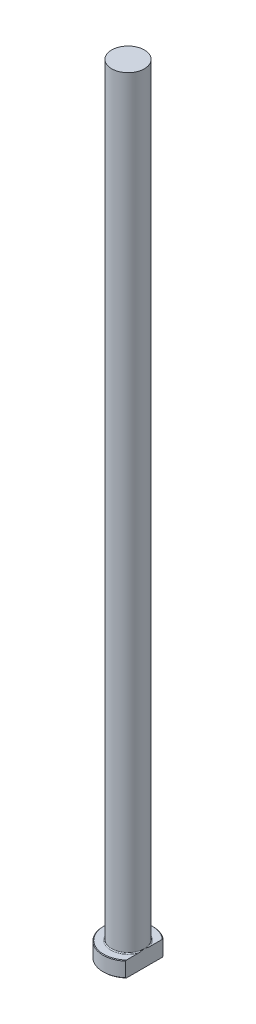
ISO-10303-21;
HEADER;
FILE_DESCRIPTION(('STEP AP214'),'2;1');
FILE_NAME('part.step','',(''),(''),'','','');
FILE_SCHEMA(('AUTOMOTIVE_DESIGN { 1 0 10303 214 1 1 1 1 }'));
ENDSEC;
DATA;
#1=APPLICATION_CONTEXT('core data for automotive mechanical design processes');
#2=APPLICATION_PROTOCOL_DEFINITION('international standard','automotive_design',2000,#1);
#3=PRODUCT_CONTEXT('',#1,'mechanical');
#4=PRODUCT('Part','Part','',(#3));
#5=PRODUCT_RELATED_PRODUCT_CATEGORY('part','',(#4));
#6=PRODUCT_DEFINITION_FORMATION('','',#4);
#7=PRODUCT_DEFINITION_CONTEXT('part definition',#1,'design');
#8=PRODUCT_DEFINITION('design','',#6,#7);
#9=PRODUCT_DEFINITION_SHAPE('','',#8);
#10=(LENGTH_UNIT() NAMED_UNIT(*) SI_UNIT(.MILLI.,.METRE.));
#11=(NAMED_UNIT(*) PLANE_ANGLE_UNIT() SI_UNIT($,.RADIAN.));
#12=(NAMED_UNIT(*) SI_UNIT($,.STERADIAN.) SOLID_ANGLE_UNIT());
#13=UNCERTAINTY_MEASURE_WITH_UNIT(LENGTH_MEASURE(1.E-05),#10,'distance_accuracy_value','');
#14=(GEOMETRIC_REPRESENTATION_CONTEXT(3) GLOBAL_UNCERTAINTY_ASSIGNED_CONTEXT((#13)) GLOBAL_UNIT_ASSIGNED_CONTEXT((#10,
#11,#12)) REPRESENTATION_CONTEXT('',''));
#15=CARTESIAN_POINT('',(0.,0.,0.));
#16=DIRECTION('',(0.,0.,1.));
#17=DIRECTION('',(1.,0.,0.));
#18=AXIS2_PLACEMENT_3D('',#15,#16,#17);
#19=CARTESIAN_POINT('',(0.,0.,0.));
#20=DIRECTION('',(0.,-1.,0.));
#21=DIRECTION('',(0.,0.,-1.));
#22=AXIS2_PLACEMENT_3D('',#19,#20,#21);
#23=PLANE('',#22);
#24=CARTESIAN_POINT('',(0.,0.,0.));
#25=DIRECTION('',(0.,-1.,0.));
#26=DIRECTION('',(0.,0.,-1.));
#27=AXIS2_PLACEMENT_3D('',#24,#25,#26);
#28=CIRCLE('',#27,7.79999999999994);
#29=CARTESIAN_POINT('',(5.24999999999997,0.,5.76866535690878));
#30=VERTEX_POINT('',#29);
#31=CARTESIAN_POINT('',(5.24999999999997,0.,-5.76866535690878));
#32=VERTEX_POINT('',#31);
#33=EDGE_CURVE('E98',#30,#32,#28,.T.);
#34=ORIENTED_EDGE('',*,*,#33,.T.);
#35=DIRECTION('',(0.,0.,1.));
#36=VECTOR('',#35,1.);
#37=CARTESIAN_POINT('',(5.24999999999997,0.,-6.0363482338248));
#38=LINE('',#37,#36);
#39=EDGE_CURVE('E83',#32,#30,#38,.T.);
#40=ORIENTED_EDGE('',*,*,#39,.T.);
#41=EDGE_LOOP('',(#34,#40));
#42=FACE_BOUND('',#41,.T.);
#43=ADVANCED_FACE('F32',(#42),#23,.T.);
#44=CARTESIAN_POINT('',(0.,259.958771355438,0.));
#45=DIRECTION('',(0.,1.,0.));
#46=DIRECTION('',(0.,0.,1.));
#47=AXIS2_PLACEMENT_3D('',#44,#45,#46);
#48=CYLINDRICAL_SURFACE('',#47,7.99999999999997);
#49=CARTESIAN_POINT('',(0.,4.80000000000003,0.));
#50=DIRECTION('',(0.,1.,0.));
#51=DIRECTION('',(0.,0.,1.));
#52=AXIS2_PLACEMENT_3D('',#49,#50,#51);
#53=CIRCLE('',#52,7.99999999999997);
#54=CARTESIAN_POINT('',(5.24999999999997,4.80000000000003,6.0363482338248));
#55=VERTEX_POINT('',#54);
#56=CARTESIAN_POINT('',(5.24999999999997,4.80000000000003,-6.0363482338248));
#57=VERTEX_POINT('',#56);
#58=EDGE_CURVE('E104',#55,#57,#53,.F.);
#59=ORIENTED_EDGE('',*,*,#58,.T.);
#60=DIRECTION('',(0.,-1.,0.));
#61=VECTOR('',#60,1.);
#62=CARTESIAN_POINT('',(5.24999999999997,250.,-6.0363482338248));
#63=LINE('',#62,#61);
#64=CARTESIAN_POINT('',(5.24999999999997,0.200000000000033,-6.0363482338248));
#65=VERTEX_POINT('',#64);
#66=EDGE_CURVE('E183',#57,#65,#63,.T.);
#67=ORIENTED_EDGE('',*,*,#66,.T.);
#68=CARTESIAN_POINT('',(0.,0.200000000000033,0.));
#69=DIRECTION('',(0.,-1.,0.));
#70=DIRECTION('',(0.,0.,-1.));
#71=AXIS2_PLACEMENT_3D('',#68,#69,#70);
#72=CIRCLE('',#71,7.99999999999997);
#73=CARTESIAN_POINT('',(5.24999999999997,0.200000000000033,6.0363482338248));
#74=VERTEX_POINT('',#73);
#75=EDGE_CURVE('E100',#65,#74,#72,.F.);
#76=ORIENTED_EDGE('',*,*,#75,.T.);
#77=DIRECTION('',(0.,-1.,0.));
#78=VECTOR('',#77,1.);
#79=CARTESIAN_POINT('',(5.24999999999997,250.,6.0363482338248));
#80=LINE('',#79,#78);
#81=EDGE_CURVE('E93',#55,#74,#80,.T.);
#82=ORIENTED_EDGE('',*,*,#81,.F.);
#83=EDGE_LOOP('',(#59,#67,#76,#82));
#84=FACE_BOUND('',#83,.T.);
#85=ADVANCED_FACE('F158',(#84),#48,.T.);
#86=CARTESIAN_POINT('',(-7.99999999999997,5.,0.));
#87=DIRECTION('',(0.,1.,0.));
#88=DIRECTION('',(0.,0.,1.));
#89=AXIS2_PLACEMENT_3D('',#86,#87,#88);
#90=PLANE('',#89);
#91=CARTESIAN_POINT('',(0.,5.,0.));
#92=DIRECTION('',(0.,1.,0.));
#93=DIRECTION('',(0.,0.,1.));
#94=AXIS2_PLACEMENT_3D('',#91,#92,#93);
#95=CIRCLE('',#94,7.79999999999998);
#96=CARTESIAN_POINT('',(5.24999999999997,5.,-5.76866535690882));
#97=VERTEX_POINT('',#96);
#98=CARTESIAN_POINT('',(5.24999999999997,5.,5.76866535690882));
#99=VERTEX_POINT('',#98);
#100=EDGE_CURVE('E178',#97,#99,#95,.T.);
#101=ORIENTED_EDGE('',*,*,#100,.T.);
#102=DIRECTION('',(0.,0.,-1.));
#103=VECTOR('',#102,1.);
#104=CARTESIAN_POINT('',(5.24999999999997,5.,0.));
#105=LINE('',#104,#103);
#106=CARTESIAN_POINT('',(5.24999999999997,4.99999999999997,1.79999999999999));
#107=VERTEX_POINT('',#106);
#108=EDGE_CURVE('E57',#99,#107,#105,.T.);
#109=ORIENTED_EDGE('',*,*,#108,.T.);
#110=CARTESIAN_POINT('',(0.,5.,0.));
#111=DIRECTION('',(0.,1.,0.));
#112=DIRECTION('',(0.,0.,1.));
#113=AXIS2_PLACEMENT_3D('',#110,#111,#112);
#114=CIRCLE('',#113,5.54999999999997);
#115=CARTESIAN_POINT('',(5.24999999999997,4.99999999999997,-1.79999999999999));
#116=VERTEX_POINT('',#115);
#117=EDGE_CURVE('E107',#107,#116,#114,.F.);
#118=ORIENTED_EDGE('',*,*,#117,.T.);
#119=EDGE_CURVE('E136',#116,#97,#105,.T.);
#120=ORIENTED_EDGE('',*,*,#119,.T.);
#121=EDGE_LOOP('',(#101,#109,#118,#120));
#122=FACE_BOUND('',#121,.T.);
#123=ADVANCED_FACE('F147',(#122),#90,.T.);
#124=CARTESIAN_POINT('',(0.,5.,0.));
#125=DIRECTION('',(0.,-1.,0.));
#126=DIRECTION('',(0.,0.,-1.));
#127=AXIS2_PLACEMENT_3D('',#124,#125,#126);
#128=CONICAL_SURFACE('',#127,7.79999999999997,0.785398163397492);
#129=ORIENTED_EDGE('',*,*,#58,.F.);
#130=CARTESIAN_POINT('',(5.24999999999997,-1.48116632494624,13.2811600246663));
#131=CARTESIAN_POINT('',(5.24999999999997,-1.29357250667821,13.0794377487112));
#132=CARTESIAN_POINT('',(5.24999999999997,-1.10628451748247,12.8774311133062));
#133=CARTESIAN_POINT('',(5.24999999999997,-0.732415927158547,12.4727618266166));
#134=CARTESIAN_POINT('',(5.24999999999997,-0.545835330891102,12.2700991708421));
#135=CARTESIAN_POINT('',(5.24999999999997,0.0127787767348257,11.6609122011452));
#136=CARTESIAN_POINT('',(5.24999999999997,0.383603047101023,11.2532764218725));
#137=CARTESIAN_POINT('',(5.24999999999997,1.12325341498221,10.4315008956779));
#138=CARTESIAN_POINT('',(5.24999999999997,1.49205195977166,10.017336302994));
#139=CARTESIAN_POINT('',(5.24999999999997,2.22349880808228,9.18368237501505));
#140=CARTESIAN_POINT('',(5.24999999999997,2.58614786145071,8.7641936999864));
#141=CARTESIAN_POINT('',(5.24999999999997,3.2300874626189,8.00331710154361));
#142=CARTESIAN_POINT('',(5.24999999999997,3.51299211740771,7.66330157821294));
#143=CARTESIAN_POINT('',(5.24999999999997,3.93141579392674,7.1483720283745));
#144=CARTESIAN_POINT('',(5.24999999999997,4.06992138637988,6.97588542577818));
#145=CARTESIAN_POINT('',(5.24999999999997,4.34452705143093,6.62901010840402));
#146=CARTESIAN_POINT('',(5.24999999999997,4.48062717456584,6.45462143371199));
#147=CARTESIAN_POINT('',(5.24999999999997,4.74973822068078,6.10383934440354));
#148=CARTESIAN_POINT('',(5.24999999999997,4.88275300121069,5.92744889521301));
#149=CARTESIAN_POINT('',(5.24999999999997,5.14521399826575,5.57203856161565));
#150=CARTESIAN_POINT('',(5.24999999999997,5.27466038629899,5.39301880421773));
#151=CARTESIAN_POINT('',(5.24999999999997,5.5290748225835,5.03192492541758));
#152=CARTESIAN_POINT('',(5.24999999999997,5.65404469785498,4.84985209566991));
#153=CARTESIAN_POINT('',(5.24999999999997,5.89840426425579,4.48201214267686));
#154=CARTESIAN_POINT('',(5.24999999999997,6.01779462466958,4.29624546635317));
#155=CARTESIAN_POINT('',(5.24999999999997,6.24171029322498,3.93290441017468));
#156=CARTESIAN_POINT('',(5.24999999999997,6.34669562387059,3.75561494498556));
#157=CARTESIAN_POINT('',(5.24999999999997,6.5488301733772,3.39656407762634));
#158=CARTESIAN_POINT('',(5.24999999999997,6.64597853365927,3.21480218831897));
#159=CARTESIAN_POINT('',(5.24999999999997,6.83020392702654,2.84629933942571));
#160=CARTESIAN_POINT('',(5.24999999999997,6.91728535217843,2.65956059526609));
#161=CARTESIAN_POINT('',(5.24999999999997,7.07861709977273,2.28058919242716));
#162=CARTESIAN_POINT('',(5.24999999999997,7.15287080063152,2.08835799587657));
#163=CARTESIAN_POINT('',(5.24999999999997,7.27107095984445,1.73993363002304));
#164=CARTESIAN_POINT('',(5.24999999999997,7.31810380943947,1.58479376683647));
#165=CARTESIAN_POINT('',(5.24999999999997,7.40035184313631,1.27142880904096));
#166=CARTESIAN_POINT('',(5.24999999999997,7.43557139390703,1.11320487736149));
#167=CARTESIAN_POINT('',(5.24999999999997,7.49247262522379,0.794842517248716));
#168=CARTESIAN_POINT('',(5.24999999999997,7.5141983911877,0.634712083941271));
#169=CARTESIAN_POINT('',(5.24999999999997,7.5431070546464,0.313132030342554));
#170=CARTESIAN_POINT('',(5.24999999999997,7.55029089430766,0.151682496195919));
#171=CARTESIAN_POINT('',(5.24999999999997,7.54968998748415,-0.1717266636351));
#172=CARTESIAN_POINT('',(5.24999999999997,7.54185529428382,-0.333686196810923));
#173=CARTESIAN_POINT('',(5.24999999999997,7.5115849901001,-0.656223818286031));
#174=CARTESIAN_POINT('',(5.24999999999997,7.48914825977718,-0.816801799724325));
#175=CARTESIAN_POINT('',(5.24999999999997,7.43080718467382,-1.13597880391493));
#176=CARTESIAN_POINT('',(5.24999999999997,7.39486058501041,-1.29456998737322));
#177=CARTESIAN_POINT('',(5.24999999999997,7.31118363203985,-1.60857875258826));
#178=CARTESIAN_POINT('',(5.24999999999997,7.26345259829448,-1.76399615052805));
#179=CARTESIAN_POINT('',(5.24999999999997,7.15315151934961,-2.08548717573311));
#180=CARTESIAN_POINT('',(5.24999999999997,7.08962117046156,-2.25122835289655));
#181=CARTESIAN_POINT('',(5.24999999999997,6.95279918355,-2.57864196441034));
#182=CARTESIAN_POINT('',(5.24999999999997,6.87950469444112,-2.74031319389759));
#183=CARTESIAN_POINT('',(5.24999999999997,6.72489088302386,-3.06007692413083));
#184=CARTESIAN_POINT('',(5.24999999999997,6.64355831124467,-3.21816296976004));
#185=CARTESIAN_POINT('',(5.24999999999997,6.47449809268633,-3.53083072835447));
#186=CARTESIAN_POINT('',(5.24999999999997,6.38677122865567,-3.68541286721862));
#187=CARTESIAN_POINT('',(5.24999999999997,6.20495786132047,-3.99346169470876));
#188=CARTESIAN_POINT('',(5.24999999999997,6.110804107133,-4.14688850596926));
#189=CARTESIAN_POINT('',(5.24999999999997,5.91814750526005,-4.45098066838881));
#190=CARTESIAN_POINT('',(5.24999999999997,5.81964456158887,-4.60164595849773));
#191=CARTESIAN_POINT('',(5.24999999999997,5.61916095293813,-4.90042904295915));
#192=CARTESIAN_POINT('',(5.24999999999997,5.51718369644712,-5.04854913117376));
#193=CARTESIAN_POINT('',(5.24999999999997,5.31027155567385,-5.3427009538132));
#194=CARTESIAN_POINT('',(5.24999999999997,5.20533670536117,-5.48873271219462));
#195=CARTESIAN_POINT('',(5.24999999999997,4.97106981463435,-5.80895105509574));
#196=CARTESIAN_POINT('',(5.24999999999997,4.84117419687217,-5.98272485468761));
#197=CARTESIAN_POINT('',(5.24999999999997,4.57844088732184,-6.32803694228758));
#198=CARTESIAN_POINT('',(5.24999999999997,4.44560309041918,-6.49957515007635));
#199=CARTESIAN_POINT('',(5.24999999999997,4.04344241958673,-7.01138747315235));
#200=CARTESIAN_POINT('',(5.24999999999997,3.77050218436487,-7.34881891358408));
#201=CARTESIAN_POINT('',(5.24999999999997,3.21761339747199,-8.01842681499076));
#202=CARTESIAN_POINT('',(5.24999999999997,2.93765803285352,-8.35059761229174));
#203=CARTESIAN_POINT('',(5.24999999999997,2.37280482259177,-9.01071908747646));
#204=CARTESIAN_POINT('',(5.24999999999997,2.08790682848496,-9.338669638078));
#205=CARTESIAN_POINT('',(5.24999999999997,1.53221513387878,-9.97104652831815));
#206=CARTESIAN_POINT('',(5.24999999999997,1.26164416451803,-10.2756690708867));
#207=CARTESIAN_POINT('',(5.24999999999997,0.717945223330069,-10.8826342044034));
#208=CARTESIAN_POINT('',(5.24999999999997,0.44481719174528,-11.184976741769));
#209=CARTESIAN_POINT('',(5.24999999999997,-0.102863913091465,-11.7871569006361));
#210=CARTESIAN_POINT('',(5.24999999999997,-0.377412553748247,-12.0869985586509));
#211=CARTESIAN_POINT('',(5.24999999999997,-0.928148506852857,-12.6851474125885));
#212=CARTESIAN_POINT('',(5.24999999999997,-1.20433574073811,-12.9834546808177));
#213=CARTESIAN_POINT('',(5.24999999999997,-1.48116632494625,-13.2811600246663));
#214=B_SPLINE_CURVE_WITH_KNOTS('',3,(#130,#131,#132,#133,#134,#135,#136,#137,#138,#139,#140,
#141,#142,#143,#144,#145,#146,#147,#148,#149,#150,#151,#152,#153,#154,#155,#156,#157,#158,#159,
#160,#161,#162,#163,#164,#165,#166,#167,#168,#169,#170,#171,#172,#173,#174,#175,#176,#177,#178,
#179,#180,#181,#182,#183,#184,#185,#186,#187,#188,#189,#190,#191,#192,#193,#194,#195,#196,#197,
#198,#199,#200,#201,#202,#203,#204,#205,#206,#207,#208,#209,#210,#211,#212,#213),.UNSPECIFIED.,
.F.,.F.,(4,2,2,2,2,2,2,2,2,2,2,2,2,2,2,2,2,2,2,2,2,2,2,2,2,2,2,2,2,2,2,2,2,2,2,2,2,2,2,2,2,4),
(0.,0.826407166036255,1.65282000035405,3.30600459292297,4.9696651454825,6.63312135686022,
7.9599789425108,8.62360280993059,9.2872127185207,9.94994254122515,10.6126404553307,
11.2750647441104,11.9374093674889,12.555381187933,13.1734206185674,13.7911893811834,
14.4087951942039,14.8947423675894,15.3805097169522,15.8646815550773,16.3488220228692,
16.8345753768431,17.3203659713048,17.8076887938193,18.2950397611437,18.8271554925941,
19.3594269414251,19.8925908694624,20.4256896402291,20.9656407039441,21.5056036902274,
22.0450513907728,22.5844928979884,23.2353229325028,23.8861762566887,25.1880335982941,
26.4912084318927,27.7944224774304,29.0167115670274,30.2390292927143,31.4586693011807,
32.6782512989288),.UNSPECIFIED.);
#215=EDGE_CURVE('E135',#55,#99,#214,.T.);
#216=ORIENTED_EDGE('',*,*,#215,.T.);
#217=ORIENTED_EDGE('',*,*,#100,.F.);
#218=EDGE_CURVE('E127',#97,#57,#214,.T.);
#219=ORIENTED_EDGE('',*,*,#218,.T.);
#220=EDGE_LOOP('',(#129,#216,#217,#219));
#221=FACE_BOUND('',#220,.T.);
#222=ADVANCED_FACE('F143',(#221),#128,.T.);
#223=CARTESIAN_POINT('',(0.,0.200000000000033,0.));
#224=DIRECTION('',(0.,1.,0.));
#225=DIRECTION('',(0.,0.,1.));
#226=AXIS2_PLACEMENT_3D('',#223,#224,#225);
#227=CONICAL_SURFACE('',#226,7.99999999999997,0.785398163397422);
#228=ORIENTED_EDGE('',*,*,#75,.F.);
#229=CARTESIAN_POINT('',(5.24999999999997,6.48116632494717,-13.2811600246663));
#230=CARTESIAN_POINT('',(5.24999999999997,6.29357250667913,-13.0794377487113));
#231=CARTESIAN_POINT('',(5.24999999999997,6.10628451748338,-12.8774311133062));
#232=CARTESIAN_POINT('',(5.24999999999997,5.73241592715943,-12.4727618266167));
#233=CARTESIAN_POINT('',(5.24999999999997,5.54583533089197,-12.2700991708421));
#234=CARTESIAN_POINT('',(5.24999999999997,4.98722122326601,-11.6609122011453));
#235=CARTESIAN_POINT('',(5.24999999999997,4.61639695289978,-11.2532764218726));
#236=CARTESIAN_POINT('',(5.24999999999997,3.87674658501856,-10.4315008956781));
#237=CARTESIAN_POINT('',(5.24999999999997,3.50794804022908,-10.0173363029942));
#238=CARTESIAN_POINT('',(5.24999999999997,2.77650119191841,-9.18368237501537));
#239=CARTESIAN_POINT('',(5.24999999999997,2.41385213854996,-8.76419369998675));
#240=CARTESIAN_POINT('',(5.24999999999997,1.76991253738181,-8.00331710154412));
#241=CARTESIAN_POINT('',(5.24999999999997,1.48700788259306,-7.66330157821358));
#242=CARTESIAN_POINT('',(5.24999999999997,1.06858420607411,-7.14837202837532));
#243=CARTESIAN_POINT('',(5.24999999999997,0.930078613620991,-6.97588542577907));
#244=CARTESIAN_POINT('',(5.24999999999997,0.655472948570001,-6.62901010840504));
#245=CARTESIAN_POINT('',(5.24999999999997,0.519372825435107,-6.45462143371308));
#246=CARTESIAN_POINT('',(5.24999999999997,0.250261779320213,-6.10383934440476));
#247=CARTESIAN_POINT('',(5.24999999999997,0.117246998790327,-5.9274488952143));
#248=CARTESIAN_POINT('',(5.24999999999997,-0.145213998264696,-5.57203856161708));
#249=CARTESIAN_POINT('',(5.24999999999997,-0.274660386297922,-5.39301880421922));
#250=CARTESIAN_POINT('',(5.24999999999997,-0.529074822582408,-5.03192492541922));
#251=CARTESIAN_POINT('',(5.24999999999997,-0.654044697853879,-4.84985209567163));
#252=CARTESIAN_POINT('',(5.24999999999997,-0.898404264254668,-4.48201214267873));
#253=CARTESIAN_POINT('',(5.24999999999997,-1.01779462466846,-4.29624546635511));
#254=CARTESIAN_POINT('',(5.24999999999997,-1.24171029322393,-3.93290441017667));
#255=CARTESIAN_POINT('',(5.24999999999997,-1.34669562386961,-3.75561494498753));
#256=CARTESIAN_POINT('',(5.24999999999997,-1.54883017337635,-3.39656407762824));
#257=CARTESIAN_POINT('',(5.24999999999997,-1.64597853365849,-3.21480218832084));
#258=CARTESIAN_POINT('',(5.24999999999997,-1.8302039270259,-2.84629933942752));
#259=CARTESIAN_POINT('',(5.24999999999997,-1.91728535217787,-2.65956059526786));
#260=CARTESIAN_POINT('',(5.24999999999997,-2.07861709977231,-2.28058919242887));
#261=CARTESIAN_POINT('',(5.24999999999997,-2.15287080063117,-2.08835799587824));
#262=CARTESIAN_POINT('',(5.24999999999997,-2.27107095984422,-1.73993363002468));
#263=CARTESIAN_POINT('',(5.24999999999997,-2.31810380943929,-1.58479376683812));
#264=CARTESIAN_POINT('',(5.24999999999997,-2.40035184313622,-1.27142880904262));
#265=CARTESIAN_POINT('',(5.24999999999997,-2.43557139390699,-1.11320487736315));
#266=CARTESIAN_POINT('',(5.24999999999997,-2.49247262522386,-0.794842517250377));
#267=CARTESIAN_POINT('',(5.24999999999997,-2.51419839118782,-0.63471208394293));
#268=CARTESIAN_POINT('',(5.24999999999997,-2.54310705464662,-0.313132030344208));
#269=CARTESIAN_POINT('',(5.24999999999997,-2.55029089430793,-0.151682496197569));
#270=CARTESIAN_POINT('',(5.24999999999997,-2.54968998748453,0.171726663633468));
#271=CARTESIAN_POINT('',(5.24999999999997,-2.54185529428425,0.333686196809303));
#272=CARTESIAN_POINT('',(5.24999999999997,-2.51158499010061,0.656223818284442));
#273=CARTESIAN_POINT('',(5.24999999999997,-2.48914825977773,0.816801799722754));
#274=CARTESIAN_POINT('',(5.24999999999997,-2.43080718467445,1.1359788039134));
#275=CARTESIAN_POINT('',(5.24999999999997,-2.39486058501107,1.2945699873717));
#276=CARTESIAN_POINT('',(5.24999999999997,-2.31118363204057,1.60857875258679));
#277=CARTESIAN_POINT('',(5.24999999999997,-2.26345259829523,1.7639961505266));
#278=CARTESIAN_POINT('',(5.24999999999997,-2.15315151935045,2.08548717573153));
#279=CARTESIAN_POINT('',(5.24999999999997,-2.0896211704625,2.25122835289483));
#280=CARTESIAN_POINT('',(5.24999999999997,-1.95279918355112,2.57864196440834));
#281=CARTESIAN_POINT('',(5.24999999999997,-1.87950469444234,2.74031319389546));
#282=CARTESIAN_POINT('',(5.24999999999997,-1.72489088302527,3.06007692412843));
#283=CARTESIAN_POINT('',(5.24999999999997,-1.64355831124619,3.21816296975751));
#284=CARTESIAN_POINT('',(5.24999999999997,-1.47449809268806,3.53083072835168));
#285=CARTESIAN_POINT('',(5.24999999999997,-1.38677122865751,3.68541286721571));
#286=CARTESIAN_POINT('',(5.24999999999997,-1.20495786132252,3.99346169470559));
#287=CARTESIAN_POINT('',(5.24999999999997,-1.11080410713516,4.14688850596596));
#288=CARTESIAN_POINT('',(5.24999999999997,-0.918147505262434,4.45098066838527));
#289=CARTESIAN_POINT('',(5.24999999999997,-0.81964456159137,4.60164595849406));
#290=CARTESIAN_POINT('',(5.24999999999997,-0.619160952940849,4.90042904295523));
#291=CARTESIAN_POINT('',(5.24999999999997,-0.517183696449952,5.04854913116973));
#292=CARTESIAN_POINT('',(5.24999999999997,-0.310271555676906,5.34270095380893));
#293=CARTESIAN_POINT('',(5.24999999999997,-0.205336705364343,5.48873271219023));
#294=CARTESIAN_POINT('',(5.24999999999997,0.0289301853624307,5.80895105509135));
#295=CARTESIAN_POINT('',(5.24999999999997,0.158825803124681,5.98272485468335));
#296=CARTESIAN_POINT('',(5.24999999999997,0.421559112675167,6.32803694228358));
#297=CARTESIAN_POINT('',(5.24999999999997,0.554396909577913,6.49957515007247));
#298=CARTESIAN_POINT('',(5.24999999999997,0.956557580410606,7.01138747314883));
#299=CARTESIAN_POINT('',(5.24999999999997,1.22949781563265,7.34881891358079));
#300=CARTESIAN_POINT('',(5.24999999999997,1.78238660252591,8.01842681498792));
#301=CARTESIAN_POINT('',(5.24999999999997,2.06234196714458,8.35059761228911));
#302=CARTESIAN_POINT('',(5.24999999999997,2.62719517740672,9.01071908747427));
#303=CARTESIAN_POINT('',(5.24999999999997,2.91209317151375,9.33866963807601));
#304=CARTESIAN_POINT('',(5.24999999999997,3.4677848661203,9.97104652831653));
#305=CARTESIAN_POINT('',(5.24999999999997,3.73835583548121,10.2756690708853));
#306=CARTESIAN_POINT('',(5.24999999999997,4.28205477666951,10.8826342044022));
#307=CARTESIAN_POINT('',(5.24999999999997,4.55518280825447,11.184976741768));
#308=CARTESIAN_POINT('',(5.24999999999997,5.10286391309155,11.7871569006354));
#309=CARTESIAN_POINT('',(5.24999999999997,5.3774125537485,12.0869985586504));
#310=CARTESIAN_POINT('',(5.24999999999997,5.92814850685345,12.6851474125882));
#311=CARTESIAN_POINT('',(5.24999999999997,6.20433574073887,12.9834546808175));
#312=CARTESIAN_POINT('',(5.24999999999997,6.48116632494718,13.2811600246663));
#313=B_SPLINE_CURVE_WITH_KNOTS('',3,(#229,#230,#231,#232,#233,#234,#235,#236,#237,#238,#239,
#240,#241,#242,#243,#244,#245,#246,#247,#248,#249,#250,#251,#252,#253,#254,#255,#256,#257,#258,
#259,#260,#261,#262,#263,#264,#265,#266,#267,#268,#269,#270,#271,#272,#273,#274,#275,#276,#277,
#278,#279,#280,#281,#282,#283,#284,#285,#286,#287,#288,#289,#290,#291,#292,#293,#294,#295,#296,
#297,#298,#299,#300,#301,#302,#303,#304,#305,#306,#307,#308,#309,#310,#311,#312),.UNSPECIFIED.,
.F.,.F.,(4,2,2,2,2,2,2,2,2,2,2,2,2,2,2,2,2,2,2,2,2,2,2,2,2,2,2,2,2,2,2,2,2,2,2,2,2,2,2,2,2,4),
(0.,0.826407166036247,1.65282000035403,3.30600459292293,4.96966514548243,6.63312135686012,
7.9599789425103,8.62360280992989,9.28721271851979,9.94994254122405,10.6126404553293,
11.2750647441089,11.9374093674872,12.5553811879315,13.1734206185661,13.7911893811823,
14.4087951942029,14.8947423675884,15.3805097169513,15.8646815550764,16.3488220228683,
16.8345753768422,17.320365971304,17.8076887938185,18.2950397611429,18.8271554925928,
19.3594269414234,19.8925908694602,20.4256896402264,20.9656407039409,21.5056036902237,
22.0450513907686,22.5844928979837,23.2353229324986,23.8861762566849,25.1880335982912,
26.4912084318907,27.7944224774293,29.0167115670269,30.2390292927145,31.4586693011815,
32.6782512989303),.UNSPECIFIED.);
#314=EDGE_CURVE('E86',#65,#32,#313,.T.);
#315=ORIENTED_EDGE('',*,*,#314,.T.);
#316=ORIENTED_EDGE('',*,*,#33,.F.);
#317=EDGE_CURVE('E89',#30,#74,#313,.T.);
#318=ORIENTED_EDGE('',*,*,#317,.T.);
#319=EDGE_LOOP('',(#228,#315,#316,#318));
#320=FACE_BOUND('',#319,.T.);
#321=ADVANCED_FACE('F97',(#320),#227,.T.);
#322=CARTESIAN_POINT('',(0.,5.29999999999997,0.));
#323=DIRECTION('',(0.,1.,0.));
#324=DIRECTION('',(0.,0.,1.));
#325=AXIS2_PLACEMENT_3D('',#322,#323,#324);
#326=TOROIDAL_SURFACE('',#325,5.54999999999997,0.3);
#327=CARTESIAN_POINT('',(5.24999999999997,5.29999999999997,0.));
#328=CARTESIAN_POINT('',(5.24999999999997,5.30000062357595,1.16656166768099E-10));
#329=CARTESIAN_POINT('',(5.24999999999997,5.30000124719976,-2.61240012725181E-07));
#330=CARTESIAN_POINT('',(5.24999999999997,5.30000240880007,-9.73737247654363E-07));
#331=CARTESIAN_POINT('',(5.24999999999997,5.3000029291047,-1.44300381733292E-06));
#332=CARTESIAN_POINT('',(5.24999999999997,5.30000402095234,-2.56984529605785E-06));
#333=CARTESIAN_POINT('',(5.24999999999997,5.30000457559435,-3.24572224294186E-06));
#334=CARTESIAN_POINT('',(5.24999999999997,5.30000555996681,-4.63899443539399E-06));
#335=CARTESIAN_POINT('',(5.24999999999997,5.30000599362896,-5.35385174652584E-06));
#336=CARTESIAN_POINT('',(5.24999999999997,5.30000762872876,-8.15275638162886E-06));
#337=CARTESIAN_POINT('',(5.24999999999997,5.30000874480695,-1.02903375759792E-05));
#338=CARTESIAN_POINT('',(5.24999999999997,5.30001055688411,-1.44997307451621E-05));
#339=CARTESIAN_POINT('',(5.24999999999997,5.30001128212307,-1.65594410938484E-05));
#340=CARTESIAN_POINT('',(5.24999999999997,5.30001436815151,-2.53621688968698E-05));
#341=CARTESIAN_POINT('',(5.24999999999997,5.30001670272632,-3.21176555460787E-05));
#342=CARTESIAN_POINT('',(5.24999999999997,5.30002009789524,-4.48185660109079E-05));
#343=CARTESIAN_POINT('',(5.24999999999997,5.30002130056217,-5.07256098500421E-05));
#344=CARTESIAN_POINT('',(5.24999999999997,5.300030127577,-9.48741140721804E-05));
#345=CARTESIAN_POINT('',(5.24999999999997,5.30003689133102,-0.000133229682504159));
#346=CARTESIAN_POINT('',(5.24999999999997,5.30006649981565,-0.00028531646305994));
#347=CARTESIAN_POINT('',(5.24999999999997,5.30009467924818,-0.000398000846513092));
#348=CARTESIAN_POINT('',(5.24999999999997,5.30020485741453,-0.000845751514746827));
#349=CARTESIAN_POINT('',(5.24999999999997,5.30028346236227,-0.00118137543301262));
#350=CARTESIAN_POINT('',(5.24999999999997,5.30059922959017,-0.00251998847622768));
#351=CARTESIAN_POINT('',(5.24999999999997,5.30084070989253,-0.0035222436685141));
#352=CARTESIAN_POINT('',(5.24999999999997,5.3018480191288,-0.00771382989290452));
#353=CARTESIAN_POINT('',(5.24999999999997,5.30260840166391,-0.0109040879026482));
#354=CARTESIAN_POINT('',(5.24999999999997,5.30980219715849,-0.0410723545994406));
#355=CARTESIAN_POINT('',(5.24999999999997,5.31625953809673,-0.0680464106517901));
#356=CARTESIAN_POINT('',(5.24999999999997,5.32887570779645,-0.120910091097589));
#357=CARTESIAN_POINT('',(5.24999999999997,5.33503603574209,-0.146799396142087));
#358=CARTESIAN_POINT('',(5.24999999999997,5.34810832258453,-0.201908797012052));
#359=CARTESIAN_POINT('',(5.24999999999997,5.35501531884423,-0.231130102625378));
#360=CARTESIAN_POINT('',(5.24999999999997,5.3688279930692,-0.289915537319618));
#361=CARTESIAN_POINT('',(5.24999999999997,5.37573280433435,-0.31947986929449));
#362=CARTESIAN_POINT('',(5.24999999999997,5.39233240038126,-0.391129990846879));
#363=CARTESIAN_POINT('',(5.24999999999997,5.40197331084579,-0.433228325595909));
#364=CARTESIAN_POINT('',(5.24999999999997,5.42071775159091,-0.516417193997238));
#365=CARTESIAN_POINT('',(5.24999999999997,5.42982871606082,-0.557506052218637));
#366=CARTESIAN_POINT('',(5.24999999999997,5.45024545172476,-0.651521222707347));
#367=CARTESIAN_POINT('',(5.24999999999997,5.46143398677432,-0.70447326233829));
#368=CARTESIAN_POINT('',(5.24999999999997,5.48311687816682,-0.810941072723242));
#369=CARTESIAN_POINT('',(5.24999999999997,5.49360525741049,-0.864458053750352));
#370=CARTESIAN_POINT('',(5.24999999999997,5.5252275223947,-1.03405951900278));
#371=CARTESIAN_POINT('',(5.24999999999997,5.54454970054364,-1.15049679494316));
#372=CARTESIAN_POINT('',(5.24999999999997,5.57371765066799,-1.36731361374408));
#373=CARTESIAN_POINT('',(5.24999999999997,5.58453543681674,-1.4675540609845));
#374=CARTESIAN_POINT('',(5.24999999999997,5.59494335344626,-1.61734655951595));
#375=CARTESIAN_POINT('',(5.24999999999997,5.5974458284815,-1.66669122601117));
#376=CARTESIAN_POINT('',(5.24999999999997,5.60018139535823,-1.76542367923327));
#377=CARTESIAN_POINT('',(5.24999999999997,5.60041538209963,-1.81481144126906));
#378=CARTESIAN_POINT('',(5.24999999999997,5.59770699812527,-1.92992281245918));
#379=CARTESIAN_POINT('',(5.24999999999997,5.59368653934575,-1.99563731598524));
#380=CARTESIAN_POINT('',(5.24999999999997,5.58239535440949,-2.09375112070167));
#381=CARTESIAN_POINT('',(5.24999999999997,5.5777387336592,-2.12645109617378));
#382=CARTESIAN_POINT('',(5.24999999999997,5.56623568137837,-2.19145637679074));
#383=CARTESIAN_POINT('',(5.24999999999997,5.55939081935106,-2.22376194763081));
#384=CARTESIAN_POINT('',(5.24999999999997,5.54289171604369,-2.28774017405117));
#385=CARTESIAN_POINT('',(5.24999999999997,5.53323089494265,-2.31941115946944));
#386=CARTESIAN_POINT('',(5.24999999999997,5.5101870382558,-2.38130147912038));
#387=CARTESIAN_POINT('',(5.24999999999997,5.49682279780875,-2.41152726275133));
#388=CARTESIAN_POINT('',(5.24999999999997,5.47383686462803,-2.45267588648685));
#389=CARTESIAN_POINT('',(5.24999999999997,5.46640062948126,-2.46481176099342));
#390=CARTESIAN_POINT('',(5.24999999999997,5.45028535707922,-2.48829012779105));
#391=CARTESIAN_POINT('',(5.24999999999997,5.44160336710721,-2.49963063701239));
#392=CARTESIAN_POINT('',(5.24999999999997,5.42264067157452,-2.52121093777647));
#393=CARTESIAN_POINT('',(5.24999999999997,5.41233846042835,-2.53143222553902));
#394=CARTESIAN_POINT('',(5.24999999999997,5.39001295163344,-2.54977752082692));
#395=CARTESIAN_POINT('',(5.24999999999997,5.3779990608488,-2.55791235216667));
#396=CARTESIAN_POINT('',(5.24999999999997,5.35800000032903,-2.56805143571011));
#397=CARTESIAN_POINT('',(5.24999999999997,5.3505843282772,-2.57117564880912));
#398=CARTESIAN_POINT('',(5.24999999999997,5.33534289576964,-2.57618429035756));
#399=CARTESIAN_POINT('',(5.24999999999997,5.32751754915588,-2.57806994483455));
#400=CARTESIAN_POINT('',(5.24999999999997,5.311605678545,-2.58043009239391));
#401=CARTESIAN_POINT('',(5.24999999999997,5.3035179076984,-2.58089637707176));
#402=CARTESIAN_POINT('',(5.24999999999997,5.28739280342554,-2.58034271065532));
#403=CARTESIAN_POINT('',(5.24999999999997,5.27935547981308,-2.5793224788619));
#404=CARTESIAN_POINT('',(5.24999999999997,5.2641286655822,-2.576023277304));
#405=CARTESIAN_POINT('',(5.24999999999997,5.25691883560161,-2.57383545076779));
#406=CARTESIAN_POINT('',(5.24999999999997,5.24289768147,-2.56843751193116));
#407=CARTESIAN_POINT('',(5.24999999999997,5.23608651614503,-2.5652269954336));
#408=CARTESIAN_POINT('',(5.24999999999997,5.21908960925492,-2.55585712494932));
#409=CARTESIAN_POINT('',(5.24999999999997,5.20925106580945,-2.54906973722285));
#410=CARTESIAN_POINT('',(5.24999999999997,5.19074002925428,-2.53405361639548));
#411=CARTESIAN_POINT('',(5.24999999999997,5.1820713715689,-2.52582033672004));
#412=CARTESIAN_POINT('',(5.24999999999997,5.15973027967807,-2.50189565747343));
#413=CARTESIAN_POINT('',(5.24999999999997,5.14713154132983,-2.4852116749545));
#414=CARTESIAN_POINT('',(5.24999999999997,5.12441873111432,-2.45028247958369));
#415=CARTESIAN_POINT('',(5.24999999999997,5.11430835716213,-2.43203499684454));
#416=CARTESIAN_POINT('',(5.24999999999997,5.095460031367,-2.39348631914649));
#417=CARTESIAN_POINT('',(5.24999999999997,5.08684143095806,-2.3731276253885));
#418=CARTESIAN_POINT('',(5.24999999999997,5.07130293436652,-2.33176174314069));
#419=CARTESIAN_POINT('',(5.24999999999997,5.0643850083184,-2.31075383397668));
#420=CARTESIAN_POINT('',(5.24999999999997,5.05188132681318,-2.26814065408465));
#421=CARTESIAN_POINT('',(5.24999999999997,5.04630843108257,-2.24653166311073));
#422=CARTESIAN_POINT('',(5.24999999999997,5.036346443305,-2.20306277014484));
#423=CARTESIAN_POINT('',(5.24999999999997,5.03195656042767,-2.18120304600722));
#424=CARTESIAN_POINT('',(5.24999999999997,5.02182394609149,-2.12403914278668));
#425=CARTESIAN_POINT('',(5.24999999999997,5.01686753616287,-2.08859566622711));
#426=CARTESIAN_POINT('',(5.24999999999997,5.00900730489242,-2.01747645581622));
#427=CARTESIAN_POINT('',(5.24999999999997,5.0061045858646,-1.98180060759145));
#428=CARTESIAN_POINT('',(5.24999999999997,4.99990490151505,-1.87441007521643));
#429=CARTESIAN_POINT('',(5.24999999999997,4.99914942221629,-1.80254846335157));
#430=CARTESIAN_POINT('',(5.24999999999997,5.00239161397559,-1.66261916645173));
#431=CARTESIAN_POINT('',(5.24999999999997,5.00615102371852,-1.59454326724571));
#432=CARTESIAN_POINT('',(5.24999999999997,5.0170133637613,-1.45862908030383));
#433=CARTESIAN_POINT('',(5.24999999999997,5.02411815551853,-1.39079094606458));
#434=CARTESIAN_POINT('',(5.24999999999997,5.04416126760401,-1.22927166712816));
#435=CARTESIAN_POINT('',(5.24999999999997,5.05829298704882,-1.1357414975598));
#436=CARTESIAN_POINT('',(5.24999999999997,5.08230499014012,-0.994796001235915));
#437=CARTESIAN_POINT('',(5.24999999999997,5.09089456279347,-0.947150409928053));
#438=CARTESIAN_POINT('',(5.24999999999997,5.10886306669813,-0.851871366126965));
#439=CARTESIAN_POINT('',(5.24999999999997,5.11824411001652,-0.804238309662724));
#440=CARTESIAN_POINT('',(5.24999999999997,5.141356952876,-0.690797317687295));
#441=CARTESIAN_POINT('',(5.24999999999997,5.15537399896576,-0.625047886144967));
#442=CARTESIAN_POINT('',(5.24999999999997,5.18409655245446,-0.494483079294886));
#443=CARTESIAN_POINT('',(5.24999999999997,5.19879244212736,-0.429665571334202));
#444=CARTESIAN_POINT('',(5.24999999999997,5.22697974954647,-0.307614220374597));
#445=CARTESIAN_POINT('',(5.24999999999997,5.24041481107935,-0.250367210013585));
#446=CARTESIAN_POINT('',(5.24999999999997,5.26812039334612,-0.133445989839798));
#447=CARTESIAN_POINT('',(5.24999999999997,5.28240186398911,-0.0737742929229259));
#448=CARTESIAN_POINT('',(5.24999999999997,5.29739294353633,-0.0108979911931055));
#449=CARTESIAN_POINT('',(5.24999999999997,5.2981548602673,-0.00770166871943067));
#450=CARTESIAN_POINT('',(5.24999999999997,5.29916252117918,-0.00350872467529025));
#451=CARTESIAN_POINT('',(5.24999999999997,5.29940286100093,-0.0025111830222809));
#452=CARTESIAN_POINT('',(5.24999999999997,5.299717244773,-0.00117843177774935));
#453=CARTESIAN_POINT('',(5.24999999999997,5.2997955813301,-0.000843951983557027));
#454=CARTESIAN_POINT('',(5.24999999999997,5.29990543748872,-0.000397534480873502));
#455=CARTESIAN_POINT('',(5.24999999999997,5.29993357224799,-0.000285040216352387));
#456=CARTESIAN_POINT('',(5.24999999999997,5.29996313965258,-0.000133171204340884));
#457=CARTESIAN_POINT('',(5.24999999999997,5.29996989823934,-9.48416473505E-05));
#458=CARTESIAN_POINT('',(5.24999999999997,5.29997871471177,-5.07197787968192E-05));
#459=CARTESIAN_POINT('',(5.24999999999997,5.29997991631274,-4.48141195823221E-05));
#460=CARTESIAN_POINT('',(5.24999999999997,5.29998330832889,-3.21161025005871E-05));
#461=CARTESIAN_POINT('',(5.24999999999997,5.29998564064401,-2.53620513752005E-05));
#462=CARTESIAN_POINT('',(5.24999999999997,5.29998872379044,-1.65608283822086E-05));
#463=CARTESIAN_POINT('',(5.24999999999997,5.29998944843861,-1.4501220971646E-05));
#464=CARTESIAN_POINT('',(5.24999999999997,5.29999125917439,-1.02919418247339E-05));
#465=CARTESIAN_POINT('',(5.24999999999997,5.29999237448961,-8.15435788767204E-06));
#466=CARTESIAN_POINT('',(5.24999999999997,5.29999400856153,-5.35534366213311E-06));
#467=CARTESIAN_POINT('',(5.24999999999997,5.29999444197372,-4.6404252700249E-06));
#468=CARTESIAN_POINT('',(5.24999999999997,5.2999954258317,-3.24698579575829E-06));
#469=CARTESIAN_POINT('',(5.24999999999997,5.29999598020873,-2.57100068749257E-06));
#470=CARTESIAN_POINT('',(5.24999999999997,5.29999707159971,-1.44390781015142E-06));
#471=CARTESIAN_POINT('',(5.24999999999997,5.29999759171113,-9.74508164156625E-07));
#472=CARTESIAN_POINT('',(5.24999999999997,5.29999875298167,-2.61670627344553E-07));
#473=CARTESIAN_POINT('',(5.24999999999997,5.29999937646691,-1.166481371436E-10));
#474=CARTESIAN_POINT('',(5.24999999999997,5.29999999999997,0.));
#475=B_SPLINE_CURVE_WITH_KNOTS('',3,(#327,#328,#329,#330,#331,#332,#333,#334,#335,#336,#337,
#338,#339,#340,#341,#342,#343,#344,#345,#346,#347,#348,#349,#350,#351,#352,#353,#354,#355,#356,
#357,#358,#359,#360,#361,#362,#363,#364,#365,#366,#367,#368,#369,#370,#371,#372,#373,#374,#375,
#376,#377,#378,#379,#380,#381,#382,#383,#384,#385,#386,#387,#388,#389,#390,#391,#392,#393,#394,
#395,#396,#397,#398,#399,#400,#401,#402,#403,#404,#405,#406,#407,#408,#409,#410,#411,#412,#413,
#414,#415,#416,#417,#418,#419,#420,#421,#422,#423,#424,#425,#426,#427,#428,#429,#430,#431,#432,
#433,#434,#435,#436,#437,#438,#439,#440,#441,#442,#443,#444,#445,#446,#447,#448,#449,#450,#451,
#452,#453,#454,#455,#456,#457,#458,#459,#460,#461,#462,#463,#464,#465,#466,#467,#468,#469,#470,
#471,#472,#473,#474),.UNSPECIFIED.,.T.,.F.,(4,2,2,2,2,2,2,2,2,2,2,2,2,2,2,2,2,2,2,2,2,2,2,2,2,2,
2,2,2,2,2,2,2,2,2,2,2,2,2,2,2,2,2,2,2,2,2,2,2,2,2,2,2,2,2,2,2,2,2,2,2,2,2,2,2,2,2,2,2,2,2,2,2,
4),(0.,1.89392886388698E-06,4.00212801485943E-06,6.60801824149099E-06,9.1153264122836E-06,
1.63248449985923E-05,2.28697708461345E-05,4.42789050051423E-05,6.23424765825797E-05,
0.000179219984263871,0.00052739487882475,0.00156181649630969,0.00465425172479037,
0.0144935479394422,0.0976999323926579,0.177536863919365,0.267616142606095,0.358695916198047,
0.488259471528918,0.61451916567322,0.776877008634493,0.940479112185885,1.29442390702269,
1.59666224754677,1.74484158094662,1.89296245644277,2.09015926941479,2.18919604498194,
2.28816194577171,2.38736097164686,2.48606549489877,2.528709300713,2.57145590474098,
2.61482708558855,2.65796850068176,2.68202106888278,2.70604979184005,2.73021721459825,
2.75438920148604,2.77690311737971,2.79942594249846,2.8350772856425,2.87084280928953,
2.93320923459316,2.99566778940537,3.06188854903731,3.12818566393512,3.19509354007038,
3.26195657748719,3.36923775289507,3.47657646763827,3.69190663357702,3.8963555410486,
4.10091834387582,4.38458684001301,4.52982429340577,4.6754623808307,4.87713507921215,
5.0765191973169,5.25292680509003,5.43699224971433,5.44685029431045,5.44992818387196,
5.45095907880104,5.45130666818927,5.4514234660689,5.45144152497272,5.45146292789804,
5.45146947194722,5.45147668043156,5.45147918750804,5.45148179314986,5.45148390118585,
5.45148579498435),.UNSPECIFIED.);
#476=CARTESIAN_POINT('',(5.24999999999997,5.29999999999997,0.));
#477=VERTEX_POINT('',#476);
#478=EDGE_CURVE('E11',#116,#477,#475,.T.);
#479=ORIENTED_EDGE('',*,*,#478,.F.);
#480=ORIENTED_EDGE('',*,*,#117,.F.);
#481=CARTESIAN_POINT('',(5.24999999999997,5.29999999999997,0.));
#482=CARTESIAN_POINT('',(5.24999999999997,5.29999937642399,-1.16656200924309E-10));
#483=CARTESIAN_POINT('',(5.24999999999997,5.29999875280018,2.61240012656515E-07));
#484=CARTESIAN_POINT('',(5.24999999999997,5.29999759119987,9.73737247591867E-07));
#485=CARTESIAN_POINT('',(5.24999999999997,5.29999707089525,1.44300381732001E-06));
#486=CARTESIAN_POINT('',(5.24999999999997,5.2999959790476,2.56984529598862E-06));
#487=CARTESIAN_POINT('',(5.24999999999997,5.29999542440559,3.2457222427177E-06));
#488=CARTESIAN_POINT('',(5.24999999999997,5.29999444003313,4.63899443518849E-06));
#489=CARTESIAN_POINT('',(5.24999999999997,5.29999400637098,5.35385174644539E-06));
#490=CARTESIAN_POINT('',(5.24999999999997,5.29999237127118,8.15275638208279E-06));
#491=CARTESIAN_POINT('',(5.24999999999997,5.29999125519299,1.02903375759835E-05));
#492=CARTESIAN_POINT('',(5.24999999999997,5.29998944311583,1.44997307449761E-05));
#493=CARTESIAN_POINT('',(5.24999999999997,5.29998871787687,1.65594410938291E-05));
#494=CARTESIAN_POINT('',(5.24999999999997,5.29998563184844,2.53621688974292E-05));
#495=CARTESIAN_POINT('',(5.24999999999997,5.29998329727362,3.21176555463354E-05));
#496=CARTESIAN_POINT('',(5.24999999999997,5.29997990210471,4.48185660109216E-05));
#497=CARTESIAN_POINT('',(5.24999999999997,5.29997869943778,5.07256098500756E-05));
#498=CARTESIAN_POINT('',(5.24999999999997,5.29996987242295,9.4874114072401E-05));
#499=CARTESIAN_POINT('',(5.24999999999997,5.29996310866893,0.000133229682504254));
#500=CARTESIAN_POINT('',(5.24999999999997,5.29993350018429,0.000285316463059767));
#501=CARTESIAN_POINT('',(5.24999999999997,5.29990532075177,0.000398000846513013));
#502=CARTESIAN_POINT('',(5.24999999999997,5.29979514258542,0.000845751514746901));
#503=CARTESIAN_POINT('',(5.24999999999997,5.29971653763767,0.00118137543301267));
#504=CARTESIAN_POINT('',(5.24999999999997,5.29940077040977,0.00251998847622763));
#505=CARTESIAN_POINT('',(5.24999999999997,5.29915929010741,0.00352224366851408));
#506=CARTESIAN_POINT('',(5.24999999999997,5.29815198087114,0.0077138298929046));
#507=CARTESIAN_POINT('',(5.24999999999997,5.29739159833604,0.0109040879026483));
#508=CARTESIAN_POINT('',(5.24999999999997,5.29019780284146,0.0410723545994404));
#509=CARTESIAN_POINT('',(5.24999999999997,5.28374046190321,0.0680464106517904));
#510=CARTESIAN_POINT('',(5.24999999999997,5.27112429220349,0.12091009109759));
#511=CARTESIAN_POINT('',(5.24999999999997,5.26496396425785,0.146799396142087));
#512=CARTESIAN_POINT('',(5.24999999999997,5.25189167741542,0.201908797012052));
#513=CARTESIAN_POINT('',(5.24999999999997,5.24498468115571,0.231130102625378));
#514=CARTESIAN_POINT('',(5.24999999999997,5.23117200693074,0.289915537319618));
#515=CARTESIAN_POINT('',(5.24999999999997,5.22426719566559,0.31947986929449));
#516=CARTESIAN_POINT('',(5.24999999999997,5.20766759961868,0.391129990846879));
#517=CARTESIAN_POINT('',(5.24999999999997,5.19802668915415,0.433228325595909));
#518=CARTESIAN_POINT('',(5.24999999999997,5.17928224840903,0.516417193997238));
#519=CARTESIAN_POINT('',(5.24999999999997,5.17017128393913,0.557506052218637));
#520=CARTESIAN_POINT('',(5.24999999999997,5.14975454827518,0.651521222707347));
#521=CARTESIAN_POINT('',(5.24999999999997,5.13856601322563,0.70447326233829));
#522=CARTESIAN_POINT('',(5.24999999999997,5.11688312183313,0.810941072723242));
#523=CARTESIAN_POINT('',(5.24999999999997,5.10639474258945,0.864458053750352));
#524=CARTESIAN_POINT('',(5.24999999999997,5.07477247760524,1.03405951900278));
#525=CARTESIAN_POINT('',(5.24999999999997,5.05545029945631,1.15049679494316));
#526=CARTESIAN_POINT('',(5.24999999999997,5.02628234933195,1.36731361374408));
#527=CARTESIAN_POINT('',(5.24999999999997,5.0154645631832,1.4675540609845));
#528=CARTESIAN_POINT('',(5.24999999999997,5.00505664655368,1.61734655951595));
#529=CARTESIAN_POINT('',(5.24999999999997,5.00255417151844,1.66669122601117));
#530=CARTESIAN_POINT('',(5.24999999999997,4.99981860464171,1.76542367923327));
#531=CARTESIAN_POINT('',(5.24999999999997,4.99958461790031,1.81481144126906));
#532=CARTESIAN_POINT('',(5.24999999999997,5.00229300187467,1.92992281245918));
#533=CARTESIAN_POINT('',(5.24999999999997,5.00631346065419,1.99563731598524));
#534=CARTESIAN_POINT('',(5.24999999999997,5.01760464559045,2.09375112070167));
#535=CARTESIAN_POINT('',(5.24999999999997,5.02226126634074,2.12645109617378));
#536=CARTESIAN_POINT('',(5.24999999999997,5.03376431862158,2.19145637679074));
#537=CARTESIAN_POINT('',(5.24999999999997,5.04060918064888,2.22376194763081));
#538=CARTESIAN_POINT('',(5.24999999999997,5.05710828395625,2.28774017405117));
#539=CARTESIAN_POINT('',(5.24999999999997,5.0667691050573,2.31941115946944));
#540=CARTESIAN_POINT('',(5.24999999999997,5.08981296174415,2.38130147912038));
#541=CARTESIAN_POINT('',(5.24999999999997,5.10317720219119,2.41152726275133));
#542=CARTESIAN_POINT('',(5.24999999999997,5.12616313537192,2.45267588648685));
#543=CARTESIAN_POINT('',(5.24999999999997,5.13359937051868,2.46481176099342));
#544=CARTESIAN_POINT('',(5.24999999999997,5.14971464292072,2.48829012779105));
#545=CARTESIAN_POINT('',(5.24999999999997,5.15839663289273,2.49963063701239));
#546=CARTESIAN_POINT('',(5.24999999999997,5.17735932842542,2.52121093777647));
#547=CARTESIAN_POINT('',(5.24999999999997,5.1876615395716,2.53143222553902));
#548=CARTESIAN_POINT('',(5.24999999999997,5.2099870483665,2.54977752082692));
#549=CARTESIAN_POINT('',(5.24999999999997,5.22200093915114,2.55791235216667));
#550=CARTESIAN_POINT('',(5.24999999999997,5.24199999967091,2.56805143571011));
#551=CARTESIAN_POINT('',(5.24999999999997,5.24941567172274,2.57117564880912));
#552=CARTESIAN_POINT('',(5.24999999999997,5.26465710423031,2.57618429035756));
#553=CARTESIAN_POINT('',(5.24999999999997,5.27248245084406,2.57806994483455));
#554=CARTESIAN_POINT('',(5.24999999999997,5.28839432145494,2.58043009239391));
#555=CARTESIAN_POINT('',(5.24999999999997,5.29648209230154,2.58089637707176));
#556=CARTESIAN_POINT('',(5.24999999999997,5.3126071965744,2.58034271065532));
#557=CARTESIAN_POINT('',(5.24999999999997,5.32064452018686,2.5793224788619));
#558=CARTESIAN_POINT('',(5.24999999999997,5.33587133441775,2.576023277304));
#559=CARTESIAN_POINT('',(5.24999999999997,5.34308116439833,2.57383545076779));
#560=CARTESIAN_POINT('',(5.24999999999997,5.35710231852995,2.56843751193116));
#561=CARTESIAN_POINT('',(5.24999999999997,5.36391348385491,2.5652269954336));
#562=CARTESIAN_POINT('',(5.24999999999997,5.38091039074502,2.55585712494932));
#563=CARTESIAN_POINT('',(5.24999999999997,5.3907489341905,2.54906973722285));
#564=CARTESIAN_POINT('',(5.24999999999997,5.40925997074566,2.53405361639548));
#565=CARTESIAN_POINT('',(5.24999999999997,5.41792862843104,2.52582033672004));
#566=CARTESIAN_POINT('',(5.24999999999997,5.44026972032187,2.50189565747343));
#567=CARTESIAN_POINT('',(5.24999999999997,5.45286845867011,2.4852116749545));
#568=CARTESIAN_POINT('',(5.24999999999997,5.47558126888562,2.45028247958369));
#569=CARTESIAN_POINT('',(5.24999999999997,5.48569164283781,2.43203499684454));
#570=CARTESIAN_POINT('',(5.24999999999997,5.50453996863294,2.39348631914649));
#571=CARTESIAN_POINT('',(5.24999999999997,5.51315856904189,2.3731276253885));
#572=CARTESIAN_POINT('',(5.24999999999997,5.52869706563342,2.33176174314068));
#573=CARTESIAN_POINT('',(5.24999999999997,5.53561499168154,2.31075383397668));
#574=CARTESIAN_POINT('',(5.24999999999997,5.54811867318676,2.26814065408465));
#575=CARTESIAN_POINT('',(5.24999999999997,5.55369156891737,2.24653166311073));
#576=CARTESIAN_POINT('',(5.24999999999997,5.56365355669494,2.20306277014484));
#577=CARTESIAN_POINT('',(5.24999999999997,5.56804343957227,2.18120304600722));
#578=CARTESIAN_POINT('',(5.24999999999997,5.57817605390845,2.12403914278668));
#579=CARTESIAN_POINT('',(5.24999999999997,5.58313246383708,2.08859566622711));
#580=CARTESIAN_POINT('',(5.24999999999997,5.59099269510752,2.01747645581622));
#581=CARTESIAN_POINT('',(5.24999999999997,5.59389541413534,1.98180060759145));
#582=CARTESIAN_POINT('',(5.24999999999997,5.6000950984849,1.87441007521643));
#583=CARTESIAN_POINT('',(5.24999999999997,5.60085057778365,1.80254846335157));
#584=CARTESIAN_POINT('',(5.24999999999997,5.59760838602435,1.66261916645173));
#585=CARTESIAN_POINT('',(5.24999999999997,5.59384897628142,1.59454326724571));
#586=CARTESIAN_POINT('',(5.24999999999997,5.58298663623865,1.45862908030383));
#587=CARTESIAN_POINT('',(5.24999999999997,5.57588184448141,1.39079094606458));
#588=CARTESIAN_POINT('',(5.24999999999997,5.55583873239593,1.22927166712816));
#589=CARTESIAN_POINT('',(5.24999999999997,5.54170701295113,1.1357414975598));
#590=CARTESIAN_POINT('',(5.24999999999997,5.51769500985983,0.994796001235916));
#591=CARTESIAN_POINT('',(5.24999999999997,5.50910543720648,0.947150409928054));
#592=CARTESIAN_POINT('',(5.24999999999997,5.49113693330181,0.851871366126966));
#593=CARTESIAN_POINT('',(5.24999999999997,5.48175588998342,0.804238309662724));
#594=CARTESIAN_POINT('',(5.24999999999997,5.45864304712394,0.690797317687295));
#595=CARTESIAN_POINT('',(5.24999999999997,5.44462600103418,0.625047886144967));
#596=CARTESIAN_POINT('',(5.24999999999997,5.41590344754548,0.494483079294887));
#597=CARTESIAN_POINT('',(5.24999999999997,5.40120755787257,0.429665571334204));
#598=CARTESIAN_POINT('',(5.24999999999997,5.37302025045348,0.307614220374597));
#599=CARTESIAN_POINT('',(5.24999999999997,5.35958518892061,0.250367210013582));
#600=CARTESIAN_POINT('',(5.24999999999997,5.33187960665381,0.133445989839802));
#601=CARTESIAN_POINT('',(5.24999999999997,5.31759813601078,0.0737742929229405));
#602=CARTESIAN_POINT('',(5.24999999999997,5.30260705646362,0.0108979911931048));
#603=CARTESIAN_POINT('',(5.24999999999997,5.30184513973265,0.00770166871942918));
#604=CARTESIAN_POINT('',(5.24999999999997,5.30083747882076,0.00350872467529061));
#605=CARTESIAN_POINT('',(5.24999999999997,5.30059713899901,0.00251118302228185));
#606=CARTESIAN_POINT('',(5.24999999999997,5.30028275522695,0.001178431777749));
#607=CARTESIAN_POINT('',(5.24999999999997,5.30020441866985,0.000843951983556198));
#608=CARTESIAN_POINT('',(5.24999999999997,5.30009456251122,0.000397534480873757));
#609=CARTESIAN_POINT('',(5.24999999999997,5.30006642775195,0.000285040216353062));
#610=CARTESIAN_POINT('',(5.24999999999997,5.30003686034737,0.000133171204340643));
#611=CARTESIAN_POINT('',(5.24999999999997,5.30003010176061,9.48416473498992E-05));
#612=CARTESIAN_POINT('',(5.24999999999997,5.30002128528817,5.07197787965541E-05));
#613=CARTESIAN_POINT('',(5.24999999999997,5.3000200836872,4.48141195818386E-05));
#614=CARTESIAN_POINT('',(5.24999999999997,5.30001669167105,3.21161024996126E-05));
#615=CARTESIAN_POINT('',(5.24999999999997,5.30001435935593,2.53620513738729E-05));
#616=CARTESIAN_POINT('',(5.24999999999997,5.3000112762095,1.65608283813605E-05));
#617=CARTESIAN_POINT('',(5.24999999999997,5.30001055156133,1.45012209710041E-05));
#618=CARTESIAN_POINT('',(5.24999999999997,5.30000874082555,1.02919418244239E-05));
#619=CARTESIAN_POINT('',(5.24999999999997,5.30000762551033,8.15435788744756E-06));
#620=CARTESIAN_POINT('',(5.24999999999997,5.30000599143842,5.35534366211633E-06));
#621=CARTESIAN_POINT('',(5.24999999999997,5.30000555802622,4.64042527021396E-06));
#622=CARTESIAN_POINT('',(5.24999999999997,5.30000457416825,3.24698579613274E-06));
#623=CARTESIAN_POINT('',(5.24999999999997,5.30000401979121,2.57100068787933E-06));
#624=CARTESIAN_POINT('',(5.24999999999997,5.30000292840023,1.44390781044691E-06));
#625=CARTESIAN_POINT('',(5.24999999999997,5.30000240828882,9.74508164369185E-07));
#626=CARTESIAN_POINT('',(5.24999999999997,5.30000124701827,2.61670627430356E-07));
#627=CARTESIAN_POINT('',(5.24999999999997,5.30000062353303,1.16648171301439E-10));
#628=CARTESIAN_POINT('',(5.24999999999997,5.29999999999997,0.));
#629=B_SPLINE_CURVE_WITH_KNOTS('',3,(#481,#482,#483,#484,#485,#486,#487,#488,#489,#490,#491,
#492,#493,#494,#495,#496,#497,#498,#499,#500,#501,#502,#503,#504,#505,#506,#507,#508,#509,#510,
#511,#512,#513,#514,#515,#516,#517,#518,#519,#520,#521,#522,#523,#524,#525,#526,#527,#528,#529,
#530,#531,#532,#533,#534,#535,#536,#537,#538,#539,#540,#541,#542,#543,#544,#545,#546,#547,#548,
#549,#550,#551,#552,#553,#554,#555,#556,#557,#558,#559,#560,#561,#562,#563,#564,#565,#566,#567,
#568,#569,#570,#571,#572,#573,#574,#575,#576,#577,#578,#579,#580,#581,#582,#583,#584,#585,#586,
#587,#588,#589,#590,#591,#592,#593,#594,#595,#596,#597,#598,#599,#600,#601,#602,#603,#604,#605,
#606,#607,#608,#609,#610,#611,#612,#613,#614,#615,#616,#617,#618,#619,#620,#621,#622,#623,#624,
#625,#626,#627,#628),.UNSPECIFIED.,.T.,.F.,(4,2,2,2,2,2,2,2,2,2,2,2,2,2,2,2,2,2,2,2,2,2,2,2,2,2,
2,2,2,2,2,2,2,2,2,2,2,2,2,2,2,2,2,2,2,2,2,2,2,2,2,2,2,2,2,2,2,2,2,2,2,2,2,2,2,2,2,2,2,2,2,2,2,
4),(0.,1.89392886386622E-06,4.00212801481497E-06,6.60801824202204E-06,9.11532641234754E-06,
1.63248449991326E-05,2.28697708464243E-05,4.42789050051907E-05,6.23424765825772E-05,
0.000179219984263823,0.000527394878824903,0.00156181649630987,0.00465425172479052,
0.0144935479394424,0.0976999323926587,0.177536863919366,0.267616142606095,0.358695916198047,
0.488259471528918,0.61451916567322,0.776877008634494,0.940479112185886,1.2944239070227,
1.59666224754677,1.74484158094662,1.89296245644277,2.09015926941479,2.18919604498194,
2.28816194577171,2.38736097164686,2.48606549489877,2.528709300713,2.57145590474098,
2.61482708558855,2.65796850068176,2.68202106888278,2.70604979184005,2.73021721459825,
2.75438920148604,2.77690311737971,2.79942594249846,2.8350772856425,2.87084280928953,
2.93320923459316,2.99566778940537,3.06188854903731,3.12818566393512,3.19509354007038,
3.26195657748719,3.36923775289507,3.47657646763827,3.69190663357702,3.8963555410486,
4.10091834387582,4.38458684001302,4.52982429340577,4.6754623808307,4.87713507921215,
5.0765191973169,5.25292680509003,5.43699224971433,5.44685029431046,5.44992818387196,
5.45095907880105,5.45130666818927,5.4514234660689,5.45144152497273,5.45146292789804,
5.45146947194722,5.45147668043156,5.45147918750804,5.45148179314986,5.45148390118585,
5.45148579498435),.UNSPECIFIED.);
#630=EDGE_CURVE('E46',#477,#107,#629,.T.);
#631=ORIENTED_EDGE('',*,*,#630,.F.);
#632=CARTESIAN_POINT('',(0.,5.29999999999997,0.));
#633=DIRECTION('',(0.,1.,0.));
#634=DIRECTION('',(0.,0.,1.));
#635=AXIS2_PLACEMENT_3D('',#632,#633,#634);
#636=CIRCLE('',#635,5.24999999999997);
#637=EDGE_CURVE('E103',#477,#477,#636,.T.);
#638=ORIENTED_EDGE('',*,*,#637,.F.);
#639=EDGE_LOOP('',(#479,#480,#631,#638));
#640=FACE_BOUND('',#639,.T.);
#641=ADVANCED_FACE('F34',(#640),#326,.F.);
#642=CARTESIAN_POINT('',(0.,259.958771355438,0.));
#643=DIRECTION('',(0.,1.,0.));
#644=DIRECTION('',(0.,0.,1.));
#645=AXIS2_PLACEMENT_3D('',#642,#643,#644);
#646=CYLINDRICAL_SURFACE('',#645,5.24999999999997);
#647=ORIENTED_EDGE('',*,*,#637,.T.);
#648=EDGE_LOOP('',(#647));
#649=FACE_BOUND('',#648,.T.);
#650=CARTESIAN_POINT('',(0.,250.,0.));
#651=DIRECTION('',(0.,1.,0.));
#652=DIRECTION('',(0.,0.,1.));
#653=AXIS2_PLACEMENT_3D('',#650,#651,#652);
#654=CIRCLE('',#653,5.24999999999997);
#655=CARTESIAN_POINT('',(0.,250.,5.24999999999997));
#656=VERTEX_POINT('',#655);
#657=EDGE_CURVE('E101',#656,#656,#654,.T.);
#658=ORIENTED_EDGE('',*,*,#657,.F.);
#659=EDGE_LOOP('',(#658));
#660=FACE_BOUND('',#659,.T.);
#661=ADVANCED_FACE('F155',(#649,#660),#646,.T.);
#662=CARTESIAN_POINT('',(-5.24999999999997,250.,0.));
#663=DIRECTION('',(0.,1.,0.));
#664=DIRECTION('',(0.,0.,1.));
#665=AXIS2_PLACEMENT_3D('',#662,#663,#664);
#666=PLANE('',#665);
#667=ORIENTED_EDGE('',*,*,#657,.T.);
#668=EDGE_LOOP('',(#667));
#669=FACE_BOUND('',#668,.T.);
#670=ADVANCED_FACE('F121',(#669),#666,.T.);
#671=CARTESIAN_POINT('',(5.24999999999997,250.,-6.0363482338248));
#672=DIRECTION('',(1.,0.,0.));
#673=DIRECTION('',(0.,0.,-1.));
#674=AXIS2_PLACEMENT_3D('',#671,#672,#673);
#675=PLANE('',#674);
#676=ORIENTED_EDGE('',*,*,#66,.F.);
#677=ORIENTED_EDGE('',*,*,#218,.F.);
#678=ORIENTED_EDGE('',*,*,#119,.F.);
#679=ORIENTED_EDGE('',*,*,#478,.T.);
#680=ORIENTED_EDGE('',*,*,#630,.T.);
#681=ORIENTED_EDGE('',*,*,#108,.F.);
#682=ORIENTED_EDGE('',*,*,#215,.F.);
#683=ORIENTED_EDGE('',*,*,#81,.T.);
#684=ORIENTED_EDGE('',*,*,#317,.F.);
#685=ORIENTED_EDGE('',*,*,#39,.F.);
#686=ORIENTED_EDGE('',*,*,#314,.F.);
#687=EDGE_LOOP('',(#676,#677,#678,#679,#680,#681,#682,#683,#684,#685,#686));
#688=FACE_BOUND('',#687,.T.);
#689=ADVANCED_FACE('F85',(#688),#675,.T.);
#690=CLOSED_SHELL('',(#43,#85,#123,#222,#321,#641,#661,#670,#689));
#691=MANIFOLD_SOLID_BREP('B2',#690);
#692=ADVANCED_BREP_SHAPE_REPRESENTATION('',(#18,#691),#14);
#693=SHAPE_DEFINITION_REPRESENTATION(#9,#692);
ENDSEC;
END-ISO-10303-21;
